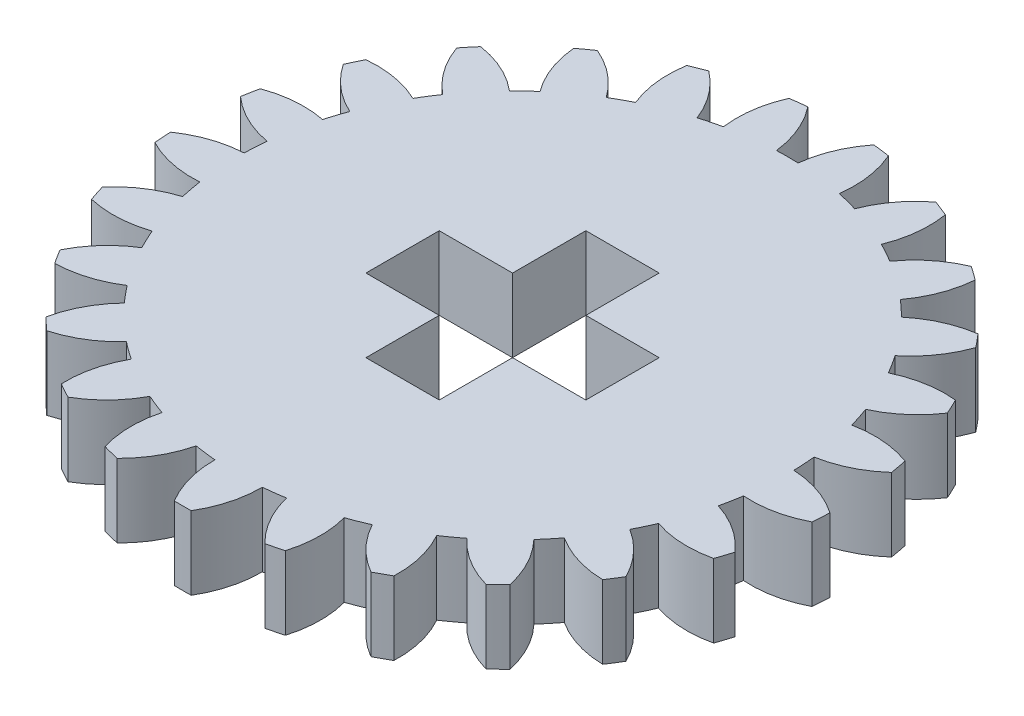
from build123d import *

# Parameters (mm, degrees)
CROQUIS1_R              = 13.5
SALIENTE_EXTRUIR1_DEPTH = 3
CORTAR_EXTRUIR1_START   = -3
CORTAR_EXTRUIR1_DEPTH   = 3
MATRIZC1_COUNT          = 25
CORTAR_EXTRUIR2_DEPTH   = 3


with BuildPart() as part:
    # Croquis1 → Saliente-Extruir1 (new body)
    with BuildSketch(Plane(origin=(0, 0, 0), x_dir=(1, 0, 0), z_dir=(0, 1, 0))):
        with Locations(Location((0, 0, 0), (0, 0, 270))):
            Circle(CROQUIS1_R)
    extrude(amount=SALIENTE_EXTRUIR1_DEPTH)

    # Croquis2 → Cortar-Extruir1 (cut)
    with BuildSketch(Plane(origin=(0, 3, 0), x_dir=(1, 0, 0), z_dir=(0, 1, 0)).offset(CORTAR_EXTRUIR1_START)):
        with BuildLine():
            ThreePointArc((0.441743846, 11.241323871), (0.742532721, 12.399916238), (1.347926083, 13.432538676))
            ThreePointArc((1.347926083, 13.432538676), (0, 13.5), (-1.347926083, 13.432538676))
            ThreePointArc((-1.347926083, 13.432538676), (-0.742532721, 12.399916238), (-0.441743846, 11.241323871))
            ThreePointArc((-0.441743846, 11.241323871), (0, 11.25), (0.441743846, 11.241323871))
        make_face()
    cortar_extruir1 = extrude(amount=CORTAR_EXTRUIR1_DEPTH, mode=Mode.SUBTRACT)

    # MatrizC1: Cortar-Extruir1 ×25 about axis
    matrizc1_axis = Axis((0, 0, 0), (0, 1, 0))
    for i in range(1, MATRIZC1_COUNT):
        add(cortar_extruir1.rotate(matrizc1_axis, i * 360 / MATRIZC1_COUNT), mode=Mode.SUBTRACT)

    # Croquis3 → Cortar-Extruir2 (cut)
    with BuildSketch(Plane(origin=(0, 3, 0), x_dir=(1, 0, 0), z_dir=(0, 1, 0))):
        Polygon((-1.5, 1.5), (-1.5, 4.5), (1.5, 4.5), (1.5, 1.5), (4.5, 1.5), (4.5, -1.5), (1.5, -1.5), (1.5, -4.5), (-1.5, -4.5), (-1.5, -1.5), (-4.5, -1.5), (-4.5, 1.5), align=None)
    extrude(amount=-CORTAR_EXTRUIR2_DEPTH, mode=Mode.SUBTRACT)


solid = part.part
